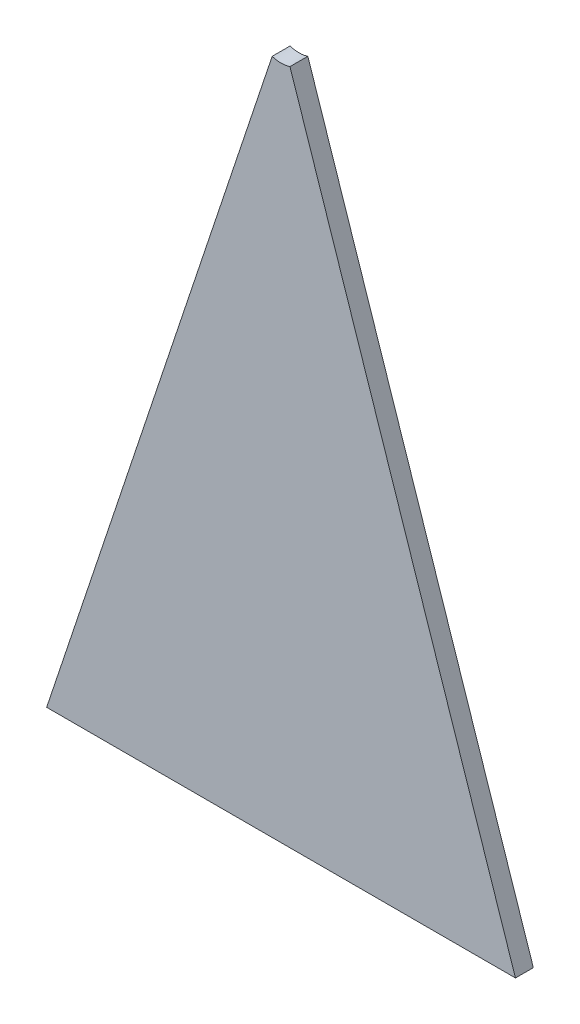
from build123d import *

# Parameters (mm, degrees)
BOSS_EXTRUDE1_DEPTH = 19.05


with BuildPart() as part:
    # Sketch1 → Boss-Extrude1 (new body)
    with BuildSketch(Plane.XY):
        with BuildLine():
            Line((0, 0), (240.513167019, 721.539501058))
            ThreePointArc((240.513167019, 721.539501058), (250, 720), (259.486832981, 721.539501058))
            Line((259.486832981, 721.539501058), (500, 0))
            Line((500, 0), (0, 0))
        make_face()
    extrude(amount=BOSS_EXTRUDE1_DEPTH)


solid = part.part
